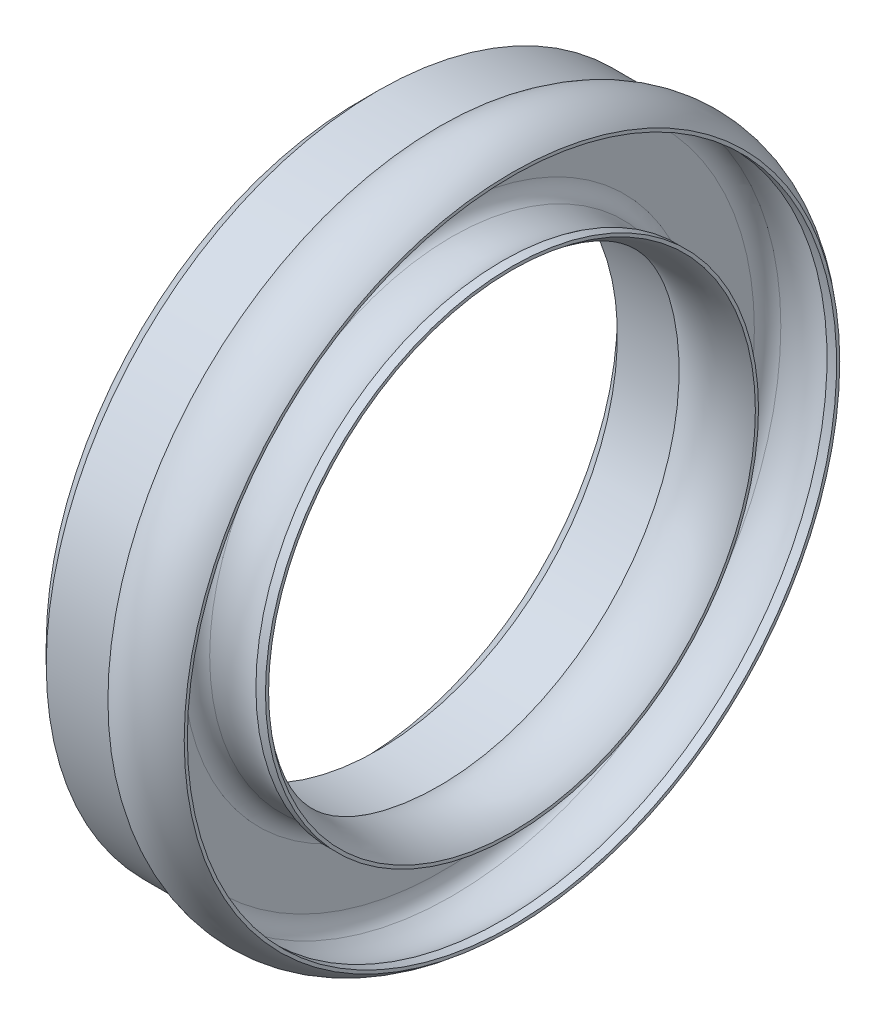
ISO-10303-21;
HEADER;
FILE_DESCRIPTION(('STEP AP214'),'2;1');
FILE_NAME('part.step','',(''),(''),'','','');
FILE_SCHEMA(('AUTOMOTIVE_DESIGN { 1 0 10303 214 1 1 1 1 }'));
ENDSEC;
DATA;
#1=APPLICATION_CONTEXT('core data for automotive mechanical design processes');
#2=APPLICATION_PROTOCOL_DEFINITION('international standard','automotive_design',2000,#1);
#3=PRODUCT_CONTEXT('',#1,'mechanical');
#4=PRODUCT('Part','Part','',(#3));
#5=PRODUCT_RELATED_PRODUCT_CATEGORY('part','',(#4));
#6=PRODUCT_DEFINITION_FORMATION('','',#4);
#7=PRODUCT_DEFINITION_CONTEXT('part definition',#1,'design');
#8=PRODUCT_DEFINITION('design','',#6,#7);
#9=PRODUCT_DEFINITION_SHAPE('','',#8);
#10=(LENGTH_UNIT() NAMED_UNIT(*) SI_UNIT(.MILLI.,.METRE.));
#11=(NAMED_UNIT(*) PLANE_ANGLE_UNIT() SI_UNIT($,.RADIAN.));
#12=(NAMED_UNIT(*) SI_UNIT($,.STERADIAN.) SOLID_ANGLE_UNIT());
#13=UNCERTAINTY_MEASURE_WITH_UNIT(LENGTH_MEASURE(1.E-05),#10,'distance_accuracy_value','');
#14=(GEOMETRIC_REPRESENTATION_CONTEXT(3) GLOBAL_UNCERTAINTY_ASSIGNED_CONTEXT((#13)) GLOBAL_UNIT_ASSIGNED_CONTEXT((#10,
#11,#12)) REPRESENTATION_CONTEXT('',''));
#15=CARTESIAN_POINT('',(0.,0.,0.));
#16=DIRECTION('',(0.,0.,1.));
#17=DIRECTION('',(1.,0.,0.));
#18=AXIS2_PLACEMENT_3D('',#15,#16,#17);
#19=CARTESIAN_POINT('',(2.79841658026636,0.,0.));
#20=DIRECTION('',(-0.999999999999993,0.,0.));
#21=DIRECTION('',(0.,0.,0.999999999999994));
#22=AXIS2_PLACEMENT_3D('',#19,#20,#21);
#23=TOROIDAL_SURFACE('',#22,8.69164894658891,0.508);
#24=CARTESIAN_POINT('',(2.57146885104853,0.,0.));
#25=DIRECTION('',(-0.999999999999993,0.,0.));
#26=DIRECTION('',(0.,0.,0.999999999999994));
#27=AXIS2_PLACEMENT_3D('',#24,#25,#26);
#28=CIRCLE('',#27,9.14613627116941);
#29=CARTESIAN_POINT('',(2.57146885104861,0.,9.14613627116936));
#30=VERTEX_POINT('',#29);
#31=EDGE_CURVE('E49',#30,#30,#28,.T.);
#32=ORIENTED_EDGE('',*,*,#31,.F.);
#33=EDGE_LOOP('',(#32));
#34=FACE_BOUND('',#33,.T.);
#35=CARTESIAN_POINT('',(2.29041658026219,0.,0.));
#36=DIRECTION('',(-0.999999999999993,0.,0.));
#37=DIRECTION('',(0.,0.,0.999999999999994));
#38=AXIS2_PLACEMENT_3D('',#35,#36,#37);
#39=CIRCLE('',#38,8.69164894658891);
#40=CARTESIAN_POINT('',(2.29041658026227,0.,8.69164894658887));
#41=VERTEX_POINT('',#40);
#42=EDGE_CURVE('E82',#41,#41,#39,.T.);
#43=ORIENTED_EDGE('',*,*,#42,.T.);
#44=EDGE_LOOP('',(#43));
#45=FACE_BOUND('',#44,.T.);
#46=ADVANCED_FACE('F30',(#34,#45),#23,.F.);
#47=CARTESIAN_POINT('',(3.17499999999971,0.,0.));
#48=DIRECTION('',(-0.999999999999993,0.,0.));
#49=DIRECTION('',(0.,0.,0.999999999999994));
#50=AXIS2_PLACEMENT_3D('',#47,#48,#49);
#51=TOROIDAL_SURFACE('',#50,7.9375,1.35094466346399);
#52=CARTESIAN_POINT('',(3.97912189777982,0.,0.));
#53=DIRECTION('',(-0.999999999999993,0.,0.));
#54=DIRECTION('',(0.,0.,0.999999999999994));
#55=AXIS2_PLACEMENT_3D('',#52,#53,#54);
#56=CIRCLE('',#55,9.02305951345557);
#57=CARTESIAN_POINT('',(3.9791218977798,0.,9.02305951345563));
#58=VERTEX_POINT('',#57);
#59=EDGE_CURVE('E52',#58,#58,#56,.T.);
#60=ORIENTED_EDGE('',*,*,#59,.F.);
#61=EDGE_LOOP('',(#60));
#62=FACE_BOUND('',#61,.T.);
#63=ORIENTED_EDGE('',*,*,#31,.T.);
#64=EDGE_LOOP('',(#63));
#65=FACE_BOUND('',#64,.T.);
#66=ADVANCED_FACE('F135',(#62,#65),#51,.F.);
#67=CARTESIAN_POINT('',(6.66133814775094E-13,0.,1.04083408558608E-13));
#68=DIRECTION('',(-0.999999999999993,0.,0.));
#69=DIRECTION('',(0.,0.,0.999999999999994));
#70=AXIS2_PLACEMENT_3D('',#67,#68,#69);
#71=CYLINDRICAL_SURFACE('',#70,9.02305951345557);
#72=CARTESIAN_POINT('',(4.24509077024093,0.,0.));
#73=DIRECTION('',(-0.999999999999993,0.,0.));
#74=DIRECTION('',(0.,0.,0.999999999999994));
#75=AXIS2_PLACEMENT_3D('',#72,#73,#74);
#76=CIRCLE('',#75,9.02305951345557);
#77=CARTESIAN_POINT('',(4.24509077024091,0.,9.02305951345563));
#78=VERTEX_POINT('',#77);
#79=EDGE_CURVE('E55',#78,#78,#76,.T.);
#80=CARTESIAN_POINT('',(4.24509077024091,0.,9.02305951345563));
#81=CARTESIAN_POINT('',(4.24232026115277,0.,9.02305951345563));
#82=CARTESIAN_POINT('',(4.23954975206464,0.,9.02305951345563));
#83=CARTESIAN_POINT('',(4.23400873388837,0.,9.02305951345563));
#84=CARTESIAN_POINT('',(4.23123822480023,0.,9.02305951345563));
#85=CARTESIAN_POINT('',(4.22569720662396,0.,9.02305951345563));
#86=CARTESIAN_POINT('',(4.22292669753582,0.,9.02305951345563));
#87=CARTESIAN_POINT('',(4.21738567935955,0.,9.02305951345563));
#88=CARTESIAN_POINT('',(4.21461517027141,0.,9.02305951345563));
#89=CARTESIAN_POINT('',(4.20907415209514,0.,9.02305951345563));
#90=CARTESIAN_POINT('',(4.206303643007,0.,9.02305951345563));
#91=CARTESIAN_POINT('',(4.20076262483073,0.,9.02305951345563));
#92=CARTESIAN_POINT('',(4.19799211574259,0.,9.02305951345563));
#93=CARTESIAN_POINT('',(4.19245109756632,0.,9.02305951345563));
#94=CARTESIAN_POINT('',(4.18968058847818,0.,9.02305951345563));
#95=CARTESIAN_POINT('',(4.18413957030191,0.,9.02305951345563));
#96=CARTESIAN_POINT('',(4.18136906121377,0.,9.02305951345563));
#97=CARTESIAN_POINT('',(4.1758280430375,0.,9.02305951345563));
#98=CARTESIAN_POINT('',(4.17305753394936,0.,9.02305951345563));
#99=CARTESIAN_POINT('',(4.16751651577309,0.,9.02305951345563));
#100=CARTESIAN_POINT('',(4.16474600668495,0.,9.02305951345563));
#101=CARTESIAN_POINT('',(4.15920498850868,0.,9.02305951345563));
#102=CARTESIAN_POINT('',(4.15643447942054,0.,9.02305951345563));
#103=CARTESIAN_POINT('',(4.15089346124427,0.,9.02305951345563));
#104=CARTESIAN_POINT('',(4.14812295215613,0.,9.02305951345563));
#105=CARTESIAN_POINT('',(4.14258193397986,0.,9.02305951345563));
#106=CARTESIAN_POINT('',(4.13981142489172,0.,9.02305951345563));
#107=CARTESIAN_POINT('',(4.13427040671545,0.,9.02305951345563));
#108=CARTESIAN_POINT('',(4.13149989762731,0.,9.02305951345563));
#109=CARTESIAN_POINT('',(4.12595887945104,0.,9.02305951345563));
#110=CARTESIAN_POINT('',(4.1231883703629,0.,9.02305951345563));
#111=CARTESIAN_POINT('',(4.11764735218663,0.,9.02305951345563));
#112=CARTESIAN_POINT('',(4.11487684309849,0.,9.02305951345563));
#113=CARTESIAN_POINT('',(4.10933582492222,0.,9.02305951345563));
#114=CARTESIAN_POINT('',(4.10656531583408,0.,9.02305951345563));
#115=CARTESIAN_POINT('',(4.10102429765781,0.,9.02305951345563));
#116=CARTESIAN_POINT('',(4.09825378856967,0.,9.02305951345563));
#117=CARTESIAN_POINT('',(4.0927127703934,0.,9.02305951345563));
#118=CARTESIAN_POINT('',(4.08994226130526,0.,9.02305951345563));
#119=CARTESIAN_POINT('',(4.08440124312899,0.,9.02305951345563));
#120=CARTESIAN_POINT('',(4.08163073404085,0.,9.02305951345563));
#121=CARTESIAN_POINT('',(4.07608971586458,0.,9.02305951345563));
#122=CARTESIAN_POINT('',(4.07331920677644,0.,9.02305951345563));
#123=CARTESIAN_POINT('',(4.06777818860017,0.,9.02305951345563));
#124=CARTESIAN_POINT('',(4.06500767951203,0.,9.02305951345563));
#125=CARTESIAN_POINT('',(4.05946666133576,0.,9.02305951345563));
#126=CARTESIAN_POINT('',(4.05669615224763,0.,9.02305951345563));
#127=CARTESIAN_POINT('',(4.05115513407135,0.,9.02305951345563));
#128=CARTESIAN_POINT('',(4.04838462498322,0.,9.02305951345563));
#129=CARTESIAN_POINT('',(4.04284360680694,0.,9.02305951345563));
#130=CARTESIAN_POINT('',(4.04007309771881,0.,9.02305951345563));
#131=CARTESIAN_POINT('',(4.03453207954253,0.,9.02305951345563));
#132=CARTESIAN_POINT('',(4.0317615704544,0.,9.02305951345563));
#133=CARTESIAN_POINT('',(4.02622055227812,0.,9.02305951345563));
#134=CARTESIAN_POINT('',(4.02345004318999,0.,9.02305951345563));
#135=CARTESIAN_POINT('',(4.01790902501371,0.,9.02305951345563));
#136=CARTESIAN_POINT('',(4.01513851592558,0.,9.02305951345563));
#137=CARTESIAN_POINT('',(4.0095974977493,0.,9.02305951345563));
#138=CARTESIAN_POINT('',(4.00682698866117,0.,9.02305951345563));
#139=CARTESIAN_POINT('',(4.0012859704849,0.,9.02305951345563));
#140=CARTESIAN_POINT('',(3.99851546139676,0.,9.02305951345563));
#141=CARTESIAN_POINT('',(3.99297444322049,0.,9.02305951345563));
#142=CARTESIAN_POINT('',(3.99020393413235,0.,9.02305951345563));
#143=CARTESIAN_POINT('',(3.98466291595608,0.,9.02305951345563));
#144=CARTESIAN_POINT('',(3.98189240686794,0.,9.02305951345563));
#145=CARTESIAN_POINT('',(3.9791218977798,0.,9.02305951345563));
#146=B_SPLINE_CURVE_WITH_KNOTS('',3,(#80,#81,#82,#83,#84,#85,#86,#87,#88,#89,#90,#91,#92,#93,
#94,#95,#96,#97,#98,#99,#100,#101,#102,#103,#104,#105,#106,#107,#108,#109,#110,#111,#112,#113,
#114,#115,#116,#117,#118,#119,#120,#121,#122,#123,#124,#125,#126,#127,#128,#129,#130,#131,#132,
#133,#134,#135,#136,#137,#138,#139,#140,#141,#142,#143,#144,#145),.UNSPECIFIED.,.F.,.F.,(4,2,2,
2,2,2,2,2,2,2,2,2,2,2,2,2,2,2,2,2,2,2,2,2,2,2,2,2,2,2,2,2,4),(0.,0.00831152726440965,
0.0166230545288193,0.0249345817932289,0.0332461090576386,0.0415576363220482,0.0498691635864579,
0.0581806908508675,0.0664922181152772,0.0748037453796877,0.0831152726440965,0.0914267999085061,
0.0997383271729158,0.108049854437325,0.116361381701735,0.124672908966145,0.132984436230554,
0.141295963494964,0.149607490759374,0.157919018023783,0.166230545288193,0.174542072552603,
0.182853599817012,0.191165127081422,0.199476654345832,0.207788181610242,0.216099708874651,
0.22441123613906,0.23272276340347,0.24103429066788,0.249345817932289,0.257657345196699,
0.265968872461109),.UNSPECIFIED.);
#147=EDGE_CURVE('BSEAM140',#78,#58,#146,.T.);
#148=ORIENTED_EDGE('',*,*,#79,.F.);
#149=ORIENTED_EDGE('',*,*,#59,.T.);
#150=ORIENTED_EDGE('',*,*,#147,.T.);
#151=ORIENTED_EDGE('',*,*,#147,.F.);
#152=EDGE_LOOP('',(#148,#150,#149,#151));
#153=FACE_BOUND('',#152,.T.);
#154=ADVANCED_FACE('F140',(#153),#71,.F.);
#155=CARTESIAN_POINT('',(4.24509077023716,9.1101303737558,0.));
#156=DIRECTION('',(-0.999999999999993,0.,0.));
#157=DIRECTION('',(0.,0.,0.999999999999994));
#158=AXIS2_PLACEMENT_3D('',#155,#156,#157);
#159=PLANE('',#158);
#160=CARTESIAN_POINT('',(4.24509077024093,0.,0.));
#161=DIRECTION('',(-0.999999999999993,0.,0.));
#162=DIRECTION('',(0.,0.,0.999999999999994));
#163=AXIS2_PLACEMENT_3D('',#160,#161,#162);
#164=CIRCLE('',#163,9.11013037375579);
#165=CARTESIAN_POINT('',(4.24509077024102,0.,9.11013037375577));
#166=VERTEX_POINT('',#165);
#167=EDGE_CURVE('E58',#166,#166,#164,.T.);
#168=ORIENTED_EDGE('',*,*,#167,.F.);
#169=EDGE_LOOP('',(#168));
#170=FACE_BOUND('',#169,.T.);
#171=ORIENTED_EDGE('',*,*,#79,.T.);
#172=EDGE_LOOP('',(#171));
#173=FACE_BOUND('',#172,.T.);
#174=ADVANCED_FACE('F147',(#170,#173),#159,.F.);
#175=CARTESIAN_POINT('',(3.17499999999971,0.,0.));
#176=DIRECTION('',(-0.999999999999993,0.,0.));
#177=DIRECTION('',(0.,0.,0.999999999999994));
#178=AXIS2_PLACEMENT_3D('',#175,#176,#177);
#179=TOROIDAL_SURFACE('',#178,7.9375,1.5875);
#180=CARTESIAN_POINT('',(2.2224999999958,0.,0.));
#181=DIRECTION('',(-0.999999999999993,0.,0.));
#182=DIRECTION('',(0.,0.,0.999999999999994));
#183=AXIS2_PLACEMENT_3D('',#180,#181,#182);
#184=CIRCLE('',#183,9.2075);
#185=CARTESIAN_POINT('',(2.22249999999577,0.,9.20750000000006));
#186=VERTEX_POINT('',#185);
#187=EDGE_CURVE('E61',#186,#186,#184,.T.);
#188=ORIENTED_EDGE('',*,*,#187,.F.);
#189=EDGE_LOOP('',(#188));
#190=FACE_BOUND('',#189,.T.);
#191=ORIENTED_EDGE('',*,*,#167,.T.);
#192=EDGE_LOOP('',(#191));
#193=FACE_BOUND('',#192,.T.);
#194=ADVANCED_FACE('F154',(#190,#193),#179,.T.);
#195=CARTESIAN_POINT('',(6.66133814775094E-13,0.,1.04083408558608E-13));
#196=DIRECTION('',(-0.999999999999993,0.,0.));
#197=DIRECTION('',(0.,0.,0.999999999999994));
#198=AXIS2_PLACEMENT_3D('',#195,#196,#197);
#199=CYLINDRICAL_SURFACE('',#198,9.2075);
#200=CARTESIAN_POINT('',(0.507999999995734,0.,0.));
#201=DIRECTION('',(0.999999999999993,0.,0.));
#202=DIRECTION('',(0.,0.,-0.999999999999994));
#203=AXIS2_PLACEMENT_3D('',#200,#201,#202);
#204=CIRCLE('',#203,9.2075);
#205=CARTESIAN_POINT('',(0.50799999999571,0.,9.20750000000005));
#206=VERTEX_POINT('',#205);
#207=EDGE_CURVE('E36',#206,#206,#204,.T.);
#208=CARTESIAN_POINT('',(0.50799999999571,0.,9.20750000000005));
#209=CARTESIAN_POINT('',(0.525859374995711,0.,9.20750000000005));
#210=CARTESIAN_POINT('',(0.543718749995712,0.,9.20750000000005));
#211=CARTESIAN_POINT('',(0.579437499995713,0.,9.20750000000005));
#212=CARTESIAN_POINT('',(0.597296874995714,0.,9.20750000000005));
#213=CARTESIAN_POINT('',(0.633015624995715,0.,9.20750000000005));
#214=CARTESIAN_POINT('',(0.650874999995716,0.,9.20750000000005));
#215=CARTESIAN_POINT('',(0.686593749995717,0.,9.20750000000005));
#216=CARTESIAN_POINT('',(0.704453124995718,0.,9.20750000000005));
#217=CARTESIAN_POINT('',(0.740171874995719,0.,9.20750000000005));
#218=CARTESIAN_POINT('',(0.75803124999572,0.,9.20750000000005));
#219=CARTESIAN_POINT('',(0.793749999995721,0.,9.20750000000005));
#220=CARTESIAN_POINT('',(0.811609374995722,0.,9.20750000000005));
#221=CARTESIAN_POINT('',(0.847328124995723,0.,9.20750000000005));
#222=CARTESIAN_POINT('',(0.865187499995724,0.,9.20750000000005));
#223=CARTESIAN_POINT('',(0.900906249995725,0.,9.20750000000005));
#224=CARTESIAN_POINT('',(0.918765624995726,0.,9.20750000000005));
#225=CARTESIAN_POINT('',(0.954484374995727,0.,9.20750000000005));
#226=CARTESIAN_POINT('',(0.972343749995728,0.,9.20750000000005));
#227=CARTESIAN_POINT('',(1.00806249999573,0.,9.20750000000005));
#228=CARTESIAN_POINT('',(1.02592187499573,0.,9.20750000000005));
#229=CARTESIAN_POINT('',(1.06164062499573,0.,9.20750000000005));
#230=CARTESIAN_POINT('',(1.07949999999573,0.,9.20750000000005));
#231=CARTESIAN_POINT('',(1.11521874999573,0.,9.20750000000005));
#232=CARTESIAN_POINT('',(1.13307812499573,0.,9.20750000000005));
#233=CARTESIAN_POINT('',(1.16879687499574,0.,9.20750000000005));
#234=CARTESIAN_POINT('',(1.18665624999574,0.,9.20750000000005));
#235=CARTESIAN_POINT('',(1.22237499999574,0.,9.20750000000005));
#236=CARTESIAN_POINT('',(1.24023437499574,0.,9.20750000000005));
#237=CARTESIAN_POINT('',(1.27595312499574,0.,9.20750000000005));
#238=CARTESIAN_POINT('',(1.29381249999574,0.,9.20750000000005));
#239=CARTESIAN_POINT('',(1.32953124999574,0.,9.20750000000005));
#240=CARTESIAN_POINT('',(1.34739062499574,0.,9.20750000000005));
#241=CARTESIAN_POINT('',(1.38310937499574,0.,9.20750000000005));
#242=CARTESIAN_POINT('',(1.40096874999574,0.,9.20750000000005));
#243=CARTESIAN_POINT('',(1.43668749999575,0.,9.20750000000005));
#244=CARTESIAN_POINT('',(1.45454687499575,0.,9.20750000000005));
#245=CARTESIAN_POINT('',(1.49026562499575,0.,9.20750000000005));
#246=CARTESIAN_POINT('',(1.50812499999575,0.,9.20750000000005));
#247=CARTESIAN_POINT('',(1.54384374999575,0.,9.20750000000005));
#248=CARTESIAN_POINT('',(1.56170312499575,0.,9.20750000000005));
#249=CARTESIAN_POINT('',(1.59742187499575,0.,9.20750000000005));
#250=CARTESIAN_POINT('',(1.61528124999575,0.,9.20750000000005));
#251=CARTESIAN_POINT('',(1.65099999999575,0.,9.20750000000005));
#252=CARTESIAN_POINT('',(1.66885937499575,0.,9.20750000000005));
#253=CARTESIAN_POINT('',(1.70457812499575,0.,9.20750000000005));
#254=CARTESIAN_POINT('',(1.72243749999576,0.,9.20750000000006));
#255=CARTESIAN_POINT('',(1.75815624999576,0.,9.20750000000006));
#256=CARTESIAN_POINT('',(1.77601562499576,0.,9.20750000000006));
#257=CARTESIAN_POINT('',(1.81173437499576,0.,9.20750000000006));
#258=CARTESIAN_POINT('',(1.82959374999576,0.,9.20750000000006));
#259=CARTESIAN_POINT('',(1.86531249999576,0.,9.20750000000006));
#260=CARTESIAN_POINT('',(1.88317187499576,0.,9.20750000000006));
#261=CARTESIAN_POINT('',(1.91889062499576,0.,9.20750000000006));
#262=CARTESIAN_POINT('',(1.93674999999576,0.,9.20750000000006));
#263=CARTESIAN_POINT('',(1.97246874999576,0.,9.20750000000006));
#264=CARTESIAN_POINT('',(1.99032812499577,0.,9.20750000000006));
#265=CARTESIAN_POINT('',(2.02604687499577,0.,9.20750000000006));
#266=CARTESIAN_POINT('',(2.04390624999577,0.,9.20750000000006));
#267=CARTESIAN_POINT('',(2.07962499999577,0.,9.20750000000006));
#268=CARTESIAN_POINT('',(2.09748437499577,0.,9.20750000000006));
#269=CARTESIAN_POINT('',(2.13320312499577,0.,9.20750000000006));
#270=CARTESIAN_POINT('',(2.15106249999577,0.,9.20750000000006));
#271=CARTESIAN_POINT('',(2.18678124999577,0.,9.20750000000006));
#272=CARTESIAN_POINT('',(2.20464062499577,0.,9.20750000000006));
#273=CARTESIAN_POINT('',(2.22249999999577,0.,9.20750000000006));
#274=B_SPLINE_CURVE_WITH_KNOTS('',3,(#208,#209,#210,#211,#212,#213,#214,#215,#216,#217,#218,
#219,#220,#221,#222,#223,#224,#225,#226,#227,#228,#229,#230,#231,#232,#233,#234,#235,#236,#237,
#238,#239,#240,#241,#242,#243,#244,#245,#246,#247,#248,#249,#250,#251,#252,#253,#254,#255,#256,
#257,#258,#259,#260,#261,#262,#263,#264,#265,#266,#267,#268,#269,#270,#271,#272,#273),
.UNSPECIFIED.,.F.,.F.,(4,2,2,2,2,2,2,2,2,2,2,2,2,2,2,2,2,2,2,2,2,2,2,2,2,2,2,2,2,2,2,2,4),(0.,
0.053578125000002,0.107156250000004,0.160734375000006,0.214312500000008,0.26789062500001,
0.321468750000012,0.375046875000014,0.428625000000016,0.482203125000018,0.53578125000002,
0.589359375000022,0.642937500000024,0.696515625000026,0.750093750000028,0.80367187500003,
0.857250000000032,0.910828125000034,0.964406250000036,1.01798437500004,1.07156250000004,
1.12514062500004,1.17871875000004,1.23229687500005,1.28587500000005,1.33945312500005,
1.39303125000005,1.44660937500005,1.50018750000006,1.55376562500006,1.60734375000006,
1.66092187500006,1.71450000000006),.UNSPECIFIED.);
#275=EDGE_CURVE('BSEAM131',#206,#186,#274,.T.);
#276=ORIENTED_EDGE('',*,*,#207,.T.);
#277=ORIENTED_EDGE('',*,*,#187,.T.);
#278=ORIENTED_EDGE('',*,*,#275,.T.);
#279=ORIENTED_EDGE('',*,*,#275,.F.);
#280=EDGE_LOOP('',(#276,#278,#277,#279));
#281=FACE_BOUND('',#280,.T.);
#282=ADVANCED_FACE('F131',(#281),#199,.T.);
#283=CARTESIAN_POINT('',(-4.44089209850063E-13,6.66750000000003,0.));
#284=DIRECTION('',(0.999999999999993,0.,0.));
#285=DIRECTION('',(0.,0.,-0.999999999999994));
#286=AXIS2_PLACEMENT_3D('',#283,#284,#285);
#287=PLANE('',#286);
#288=CARTESIAN_POINT('',(6.66133814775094E-13,0.,1.04083408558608E-13));
#289=DIRECTION('',(0.999999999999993,0.,0.));
#290=DIRECTION('',(0.,0.,-0.999999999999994));
#291=AXIS2_PLACEMENT_3D('',#288,#289,#290);
#292=CIRCLE('',#291,8.69949999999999);
#293=CARTESIAN_POINT('',(5.88655455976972E-13,0.,-8.69949999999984));
#294=VERTEX_POINT('',#293);
#295=EDGE_CURVE('E40',#294,#294,#292,.F.);
#296=ORIENTED_EDGE('',*,*,#295,.T.);
#297=EDGE_LOOP('',(#296));
#298=FACE_BOUND('',#297,.T.);
#299=CARTESIAN_POINT('',(6.66133814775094E-13,0.,1.04083408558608E-13));
#300=DIRECTION('',(0.999999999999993,0.,0.));
#301=DIRECTION('',(0.,0.,-0.999999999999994));
#302=AXIS2_PLACEMENT_3D('',#299,#300,#301);
#303=CIRCLE('',#302,7.1755);
#304=CARTESIAN_POINT('',(6.47810798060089E-13,0.,7.17549999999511));
#305=VERTEX_POINT('',#304);
#306=EDGE_CURVE('E44',#305,#305,#303,.T.);
#307=ORIENTED_EDGE('',*,*,#306,.T.);
#308=EDGE_LOOP('',(#307));
#309=FACE_BOUND('',#308,.T.);
#310=ADVANCED_FACE('F126',(#298,#309),#287,.F.);
#311=CARTESIAN_POINT('',(6.66133814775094E-13,0.,1.04083408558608E-13));
#312=DIRECTION('',(-0.999999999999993,0.,0.));
#313=DIRECTION('',(0.,0.,0.999999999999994));
#314=AXIS2_PLACEMENT_3D('',#311,#312,#313);
#315=CYLINDRICAL_SURFACE('',#314,6.6675);
#316=CARTESIAN_POINT('',(0.507999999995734,0.,0.));
#317=DIRECTION('',(0.999999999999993,0.,0.));
#318=DIRECTION('',(0.,0.,-0.999999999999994));
#319=AXIS2_PLACEMENT_3D('',#316,#317,#318);
#320=CIRCLE('',#319,6.6675);
#321=CARTESIAN_POINT('',(0.507999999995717,0.,6.66750000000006));
#322=VERTEX_POINT('',#321);
#323=EDGE_CURVE('E10',#322,#322,#320,.F.);
#324=CARTESIAN_POINT('',(2.2224999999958,0.,0.));
#325=DIRECTION('',(-0.999999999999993,0.,0.));
#326=DIRECTION('',(0.,0.,0.999999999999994));
#327=AXIS2_PLACEMENT_3D('',#324,#325,#326);
#328=CIRCLE('',#327,6.66749999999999);
#329=CARTESIAN_POINT('',(2.22249999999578,0.,6.66750000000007));
#330=VERTEX_POINT('',#329);
#331=EDGE_CURVE('E64',#330,#330,#328,.T.);
#332=CARTESIAN_POINT('',(0.507999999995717,0.,6.66750000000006));
#333=CARTESIAN_POINT('',(0.525859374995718,0.,6.66750000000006));
#334=CARTESIAN_POINT('',(0.543718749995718,0.,6.66750000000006));
#335=CARTESIAN_POINT('',(0.57943749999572,0.,6.66750000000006));
#336=CARTESIAN_POINT('',(0.59729687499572,0.,6.66750000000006));
#337=CARTESIAN_POINT('',(0.633015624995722,0.,6.66750000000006));
#338=CARTESIAN_POINT('',(0.650874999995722,0.,6.66750000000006));
#339=CARTESIAN_POINT('',(0.686593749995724,0.,6.66750000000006));
#340=CARTESIAN_POINT('',(0.704453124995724,0.,6.66750000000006));
#341=CARTESIAN_POINT('',(0.740171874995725,0.,6.66750000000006));
#342=CARTESIAN_POINT('',(0.758031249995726,0.,6.66750000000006));
#343=CARTESIAN_POINT('',(0.793749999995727,0.,6.66750000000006));
#344=CARTESIAN_POINT('',(0.811609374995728,0.,6.66750000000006));
#345=CARTESIAN_POINT('',(0.847328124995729,0.,6.66750000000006));
#346=CARTESIAN_POINT('',(0.86518749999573,0.,6.66750000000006));
#347=CARTESIAN_POINT('',(0.900906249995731,0.,6.66750000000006));
#348=CARTESIAN_POINT('',(0.918765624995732,0.,6.66750000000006));
#349=CARTESIAN_POINT('',(0.954484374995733,0.,6.66750000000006));
#350=CARTESIAN_POINT('',(0.972343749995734,0.,6.66750000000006));
#351=CARTESIAN_POINT('',(1.00806249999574,0.,6.66750000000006));
#352=CARTESIAN_POINT('',(1.02592187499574,0.,6.66750000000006));
#353=CARTESIAN_POINT('',(1.06164062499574,0.,6.66750000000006));
#354=CARTESIAN_POINT('',(1.07949999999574,0.,6.66750000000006));
#355=CARTESIAN_POINT('',(1.11521874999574,0.,6.66750000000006));
#356=CARTESIAN_POINT('',(1.13307812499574,0.,6.66750000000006));
#357=CARTESIAN_POINT('',(1.16879687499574,0.,6.66750000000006));
#358=CARTESIAN_POINT('',(1.18665624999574,0.,6.66750000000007));
#359=CARTESIAN_POINT('',(1.22237499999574,0.,6.66750000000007));
#360=CARTESIAN_POINT('',(1.24023437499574,0.,6.66750000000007));
#361=CARTESIAN_POINT('',(1.27595312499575,0.,6.66750000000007));
#362=CARTESIAN_POINT('',(1.29381249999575,0.,6.66750000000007));
#363=CARTESIAN_POINT('',(1.32953124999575,0.,6.66750000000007));
#364=CARTESIAN_POINT('',(1.34739062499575,0.,6.66750000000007));
#365=CARTESIAN_POINT('',(1.38310937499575,0.,6.66750000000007));
#366=CARTESIAN_POINT('',(1.40096874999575,0.,6.66750000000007));
#367=CARTESIAN_POINT('',(1.43668749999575,0.,6.66750000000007));
#368=CARTESIAN_POINT('',(1.45454687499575,0.,6.66750000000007));
#369=CARTESIAN_POINT('',(1.49026562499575,0.,6.66750000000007));
#370=CARTESIAN_POINT('',(1.50812499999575,0.,6.66750000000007));
#371=CARTESIAN_POINT('',(1.54384374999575,0.,6.66750000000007));
#372=CARTESIAN_POINT('',(1.56170312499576,0.,6.66750000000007));
#373=CARTESIAN_POINT('',(1.59742187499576,0.,6.66750000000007));
#374=CARTESIAN_POINT('',(1.61528124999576,0.,6.66750000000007));
#375=CARTESIAN_POINT('',(1.65099999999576,0.,6.66750000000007));
#376=CARTESIAN_POINT('',(1.66885937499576,0.,6.66750000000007));
#377=CARTESIAN_POINT('',(1.70457812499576,0.,6.66750000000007));
#378=CARTESIAN_POINT('',(1.72243749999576,0.,6.66750000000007));
#379=CARTESIAN_POINT('',(1.75815624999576,0.,6.66750000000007));
#380=CARTESIAN_POINT('',(1.77601562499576,0.,6.66750000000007));
#381=CARTESIAN_POINT('',(1.81173437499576,0.,6.66750000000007));
#382=CARTESIAN_POINT('',(1.82959374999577,0.,6.66750000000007));
#383=CARTESIAN_POINT('',(1.86531249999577,0.,6.66750000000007));
#384=CARTESIAN_POINT('',(1.88317187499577,0.,6.66750000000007));
#385=CARTESIAN_POINT('',(1.91889062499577,0.,6.66750000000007));
#386=CARTESIAN_POINT('',(1.93674999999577,0.,6.66750000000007));
#387=CARTESIAN_POINT('',(1.97246874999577,0.,6.66750000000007));
#388=CARTESIAN_POINT('',(1.99032812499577,0.,6.66750000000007));
#389=CARTESIAN_POINT('',(2.02604687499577,0.,6.66750000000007));
#390=CARTESIAN_POINT('',(2.04390624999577,0.,6.66750000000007));
#391=CARTESIAN_POINT('',(2.07962499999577,0.,6.66750000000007));
#392=CARTESIAN_POINT('',(2.09748437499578,0.,6.66750000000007));
#393=CARTESIAN_POINT('',(2.13320312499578,0.,6.66750000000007));
#394=CARTESIAN_POINT('',(2.15106249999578,0.,6.66750000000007));
#395=CARTESIAN_POINT('',(2.18678124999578,0.,6.66750000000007));
#396=CARTESIAN_POINT('',(2.20464062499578,0.,6.66750000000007));
#397=CARTESIAN_POINT('',(2.22249999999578,0.,6.66750000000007));
#398=B_SPLINE_CURVE_WITH_KNOTS('',3,(#332,#333,#334,#335,#336,#337,#338,#339,#340,#341,#342,
#343,#344,#345,#346,#347,#348,#349,#350,#351,#352,#353,#354,#355,#356,#357,#358,#359,#360,#361,
#362,#363,#364,#365,#366,#367,#368,#369,#370,#371,#372,#373,#374,#375,#376,#377,#378,#379,#380,
#381,#382,#383,#384,#385,#386,#387,#388,#389,#390,#391,#392,#393,#394,#395,#396,#397),
.UNSPECIFIED.,.F.,.F.,(4,2,2,2,2,2,2,2,2,2,2,2,2,2,2,2,2,2,2,2,2,2,2,2,2,2,2,2,2,2,2,2,4),(0.,
0.053578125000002,0.107156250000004,0.160734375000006,0.214312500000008,0.26789062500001,
0.321468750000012,0.375046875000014,0.428625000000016,0.482203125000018,0.53578125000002,
0.589359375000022,0.642937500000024,0.696515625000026,0.750093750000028,0.80367187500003,
0.857250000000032,0.910828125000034,0.964406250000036,1.01798437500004,1.07156250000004,
1.12514062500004,1.17871875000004,1.23229687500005,1.28587500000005,1.33945312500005,
1.39303125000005,1.44660937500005,1.50018750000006,1.55376562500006,1.60734375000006,
1.66092187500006,1.71450000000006),.UNSPECIFIED.);
#399=EDGE_CURVE('BSEAM121',#322,#330,#398,.T.);
#400=ORIENTED_EDGE('',*,*,#323,.T.);
#401=ORIENTED_EDGE('',*,*,#331,.F.);
#402=ORIENTED_EDGE('',*,*,#399,.T.);
#403=ORIENTED_EDGE('',*,*,#399,.F.);
#404=EDGE_LOOP('',(#400,#402,#401,#403));
#405=FACE_BOUND('',#404,.T.);
#406=ADVANCED_FACE('F121',(#405),#315,.F.);
#407=CARTESIAN_POINT('',(3.17499999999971,0.,0.));
#408=DIRECTION('',(-0.999999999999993,0.,0.));
#409=DIRECTION('',(0.,0.,0.999999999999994));
#410=AXIS2_PLACEMENT_3D('',#407,#408,#409);
#411=TOROIDAL_SURFACE('',#410,7.9375,1.5875);
#412=CARTESIAN_POINT('',(4.24509077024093,0.,0.));
#413=DIRECTION('',(-0.999999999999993,0.,0.));
#414=DIRECTION('',(0.,0.,0.999999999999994));
#415=AXIS2_PLACEMENT_3D('',#412,#413,#414);
#416=CIRCLE('',#415,6.7648696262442);
#417=CARTESIAN_POINT('',(4.24509077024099,0.,6.7648696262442));
#418=VERTEX_POINT('',#417);
#419=EDGE_CURVE('E67',#418,#418,#416,.T.);
#420=ORIENTED_EDGE('',*,*,#419,.F.);
#421=EDGE_LOOP('',(#420));
#422=FACE_BOUND('',#421,.T.);
#423=ORIENTED_EDGE('',*,*,#331,.T.);
#424=EDGE_LOOP('',(#423));
#425=FACE_BOUND('',#424,.T.);
#426=ADVANCED_FACE('F115',(#422,#425),#411,.T.);
#427=CARTESIAN_POINT('',(4.24509077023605,6.85194048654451,-1.2490009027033E-13));
#428=DIRECTION('',(-0.999999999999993,0.,0.));
#429=DIRECTION('',(0.,0.,0.999999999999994));
#430=AXIS2_PLACEMENT_3D('',#427,#428,#429);
#431=PLANE('',#430);
#432=CARTESIAN_POINT('',(4.24509077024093,0.,0.));
#433=DIRECTION('',(-0.999999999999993,0.,0.));
#434=DIRECTION('',(0.,0.,0.999999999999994));
#435=AXIS2_PLACEMENT_3D('',#432,#433,#434);
#436=CIRCLE('',#435,6.85194048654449);
#437=CARTESIAN_POINT('',(4.24509077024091,0.,6.85194048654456));
#438=VERTEX_POINT('',#437);
#439=EDGE_CURVE('E70',#438,#438,#436,.T.);
#440=ORIENTED_EDGE('',*,*,#439,.F.);
#441=EDGE_LOOP('',(#440));
#442=FACE_BOUND('',#441,.T.);
#443=ORIENTED_EDGE('',*,*,#419,.T.);
#444=EDGE_LOOP('',(#443));
#445=FACE_BOUND('',#444,.T.);
#446=ADVANCED_FACE('F109',(#442,#445),#431,.F.);
#447=CARTESIAN_POINT('',(6.66133814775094E-13,0.,1.04083408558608E-13));
#448=DIRECTION('',(-0.999999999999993,0.,0.));
#449=DIRECTION('',(0.,0.,0.999999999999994));
#450=AXIS2_PLACEMENT_3D('',#447,#448,#449);
#451=CYLINDRICAL_SURFACE('',#450,6.85194048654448);
#452=CARTESIAN_POINT('',(3.97912189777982,0.,0.));
#453=DIRECTION('',(-0.999999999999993,0.,0.));
#454=DIRECTION('',(0.,0.,0.999999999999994));
#455=AXIS2_PLACEMENT_3D('',#452,#453,#454);
#456=CIRCLE('',#455,6.85194048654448);
#457=CARTESIAN_POINT('',(3.97912189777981,0.,6.85194048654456));
#458=VERTEX_POINT('',#457);
#459=EDGE_CURVE('E73',#458,#458,#456,.T.);
#460=CARTESIAN_POINT('',(3.97912189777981,0.,6.85194048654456));
#461=CARTESIAN_POINT('',(3.98189240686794,0.,6.85194048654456));
#462=CARTESIAN_POINT('',(3.98466291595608,0.,6.85194048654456));
#463=CARTESIAN_POINT('',(3.99020393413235,0.,6.85194048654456));
#464=CARTESIAN_POINT('',(3.99297444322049,0.,6.85194048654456));
#465=CARTESIAN_POINT('',(3.99851546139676,0.,6.85194048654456));
#466=CARTESIAN_POINT('',(4.0012859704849,0.,6.85194048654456));
#467=CARTESIAN_POINT('',(4.00682698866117,0.,6.85194048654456));
#468=CARTESIAN_POINT('',(4.00959749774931,0.,6.85194048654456));
#469=CARTESIAN_POINT('',(4.01513851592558,0.,6.85194048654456));
#470=CARTESIAN_POINT('',(4.01790902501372,0.,6.85194048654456));
#471=CARTESIAN_POINT('',(4.02345004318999,0.,6.85194048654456));
#472=CARTESIAN_POINT('',(4.02622055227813,0.,6.85194048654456));
#473=CARTESIAN_POINT('',(4.0317615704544,0.,6.85194048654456));
#474=CARTESIAN_POINT('',(4.03453207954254,0.,6.85194048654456));
#475=CARTESIAN_POINT('',(4.04007309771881,0.,6.85194048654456));
#476=CARTESIAN_POINT('',(4.04284360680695,0.,6.85194048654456));
#477=CARTESIAN_POINT('',(4.04838462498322,0.,6.85194048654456));
#478=CARTESIAN_POINT('',(4.05115513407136,0.,6.85194048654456));
#479=CARTESIAN_POINT('',(4.05669615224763,0.,6.85194048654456));
#480=CARTESIAN_POINT('',(4.05946666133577,0.,6.85194048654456));
#481=CARTESIAN_POINT('',(4.06500767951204,0.,6.85194048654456));
#482=CARTESIAN_POINT('',(4.06777818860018,0.,6.85194048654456));
#483=CARTESIAN_POINT('',(4.07331920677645,0.,6.85194048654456));
#484=CARTESIAN_POINT('',(4.07608971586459,0.,6.85194048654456));
#485=CARTESIAN_POINT('',(4.08163073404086,0.,6.85194048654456));
#486=CARTESIAN_POINT('',(4.084401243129,0.,6.85194048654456));
#487=CARTESIAN_POINT('',(4.08994226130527,0.,6.85194048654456));
#488=CARTESIAN_POINT('',(4.09271277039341,0.,6.85194048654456));
#489=CARTESIAN_POINT('',(4.09825378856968,0.,6.85194048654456));
#490=CARTESIAN_POINT('',(4.10102429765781,0.,6.85194048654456));
#491=CARTESIAN_POINT('',(4.10656531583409,0.,6.85194048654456));
#492=CARTESIAN_POINT('',(4.10933582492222,0.,6.85194048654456));
#493=CARTESIAN_POINT('',(4.1148768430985,0.,6.85194048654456));
#494=CARTESIAN_POINT('',(4.11764735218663,0.,6.85194048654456));
#495=CARTESIAN_POINT('',(4.12318837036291,0.,6.85194048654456));
#496=CARTESIAN_POINT('',(4.12595887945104,0.,6.85194048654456));
#497=CARTESIAN_POINT('',(4.13149989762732,0.,6.85194048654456));
#498=CARTESIAN_POINT('',(4.13427040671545,0.,6.85194048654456));
#499=CARTESIAN_POINT('',(4.13981142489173,0.,6.85194048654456));
#500=CARTESIAN_POINT('',(4.14258193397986,0.,6.85194048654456));
#501=CARTESIAN_POINT('',(4.14812295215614,0.,6.85194048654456));
#502=CARTESIAN_POINT('',(4.15089346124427,0.,6.85194048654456));
#503=CARTESIAN_POINT('',(4.15643447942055,0.,6.85194048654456));
#504=CARTESIAN_POINT('',(4.15920498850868,0.,6.85194048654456));
#505=CARTESIAN_POINT('',(4.16474600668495,0.,6.85194048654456));
#506=CARTESIAN_POINT('',(4.16751651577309,0.,6.85194048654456));
#507=CARTESIAN_POINT('',(4.17305753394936,0.,6.85194048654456));
#508=CARTESIAN_POINT('',(4.1758280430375,0.,6.85194048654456));
#509=CARTESIAN_POINT('',(4.18136906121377,0.,6.85194048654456));
#510=CARTESIAN_POINT('',(4.18413957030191,0.,6.85194048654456));
#511=CARTESIAN_POINT('',(4.18968058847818,0.,6.85194048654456));
#512=CARTESIAN_POINT('',(4.19245109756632,0.,6.85194048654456));
#513=CARTESIAN_POINT('',(4.19799211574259,0.,6.85194048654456));
#514=CARTESIAN_POINT('',(4.20076262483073,0.,6.85194048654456));
#515=CARTESIAN_POINT('',(4.206303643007,0.,6.85194048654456));
#516=CARTESIAN_POINT('',(4.20907415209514,0.,6.85194048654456));
#517=CARTESIAN_POINT('',(4.21461517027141,0.,6.85194048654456));
#518=CARTESIAN_POINT('',(4.21738567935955,0.,6.85194048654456));
#519=CARTESIAN_POINT('',(4.22292669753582,0.,6.85194048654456));
#520=CARTESIAN_POINT('',(4.22569720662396,0.,6.85194048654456));
#521=CARTESIAN_POINT('',(4.23123822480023,0.,6.85194048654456));
#522=CARTESIAN_POINT('',(4.23400873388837,0.,6.85194048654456));
#523=CARTESIAN_POINT('',(4.23954975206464,0.,6.85194048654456));
#524=CARTESIAN_POINT('',(4.24232026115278,0.,6.85194048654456));
#525=CARTESIAN_POINT('',(4.24509077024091,0.,6.85194048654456));
#526=B_SPLINE_CURVE_WITH_KNOTS('',3,(#460,#461,#462,#463,#464,#465,#466,#467,#468,#469,#470,
#471,#472,#473,#474,#475,#476,#477,#478,#479,#480,#481,#482,#483,#484,#485,#486,#487,#488,#489,
#490,#491,#492,#493,#494,#495,#496,#497,#498,#499,#500,#501,#502,#503,#504,#505,#506,#507,#508,
#509,#510,#511,#512,#513,#514,#515,#516,#517,#518,#519,#520,#521,#522,#523,#524,#525),
.UNSPECIFIED.,.F.,.F.,(4,2,2,2,2,2,2,2,2,2,2,2,2,2,2,2,2,2,2,2,2,2,2,2,2,2,2,2,2,2,2,2,4),(0.,
0.00831152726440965,0.0166230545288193,0.0249345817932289,0.0332461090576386,0.0415576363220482,
0.0498691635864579,0.0581806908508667,0.0664922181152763,0.0748037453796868,0.0831152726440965,
0.0914267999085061,0.0997383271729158,0.108049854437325,0.116361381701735,0.124672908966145,
0.132984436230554,0.141295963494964,0.149607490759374,0.157919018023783,0.166230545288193,
0.174542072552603,0.182853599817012,0.191165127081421,0.199476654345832,0.207788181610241,
0.216099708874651,0.22441123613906,0.23272276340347,0.24103429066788,0.249345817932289,
0.257657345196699,0.265968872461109),.UNSPECIFIED.);
#527=EDGE_CURVE('BSEAM103',#458,#438,#526,.T.);
#528=ORIENTED_EDGE('',*,*,#459,.F.);
#529=ORIENTED_EDGE('',*,*,#439,.T.);
#530=ORIENTED_EDGE('',*,*,#527,.T.);
#531=ORIENTED_EDGE('',*,*,#527,.F.);
#532=EDGE_LOOP('',(#528,#530,#529,#531));
#533=FACE_BOUND('',#532,.T.);
#534=ADVANCED_FACE('F103',(#533),#451,.T.);
#535=CARTESIAN_POINT('',(3.17499999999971,0.,0.));
#536=DIRECTION('',(-0.999999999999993,0.,0.));
#537=DIRECTION('',(0.,0.,0.999999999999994));
#538=AXIS2_PLACEMENT_3D('',#535,#536,#537);
#539=TOROIDAL_SURFACE('',#538,7.9375,1.35094466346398);
#540=CARTESIAN_POINT('',(2.57146885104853,0.,0.));
#541=DIRECTION('',(-0.999999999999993,0.,0.));
#542=DIRECTION('',(0.,0.,0.999999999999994));
#543=AXIS2_PLACEMENT_3D('',#540,#541,#542);
#544=CIRCLE('',#543,6.7288637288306);
#545=CARTESIAN_POINT('',(2.57146885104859,0.,6.72886372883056));
#546=VERTEX_POINT('',#545);
#547=EDGE_CURVE('E76',#546,#546,#544,.T.);
#548=ORIENTED_EDGE('',*,*,#547,.F.);
#549=EDGE_LOOP('',(#548));
#550=FACE_BOUND('',#549,.T.);
#551=ORIENTED_EDGE('',*,*,#459,.T.);
#552=EDGE_LOOP('',(#551));
#553=FACE_BOUND('',#552,.T.);
#554=ADVANCED_FACE('F97',(#550,#553),#539,.F.);
#555=CARTESIAN_POINT('',(2.79841658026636,0.,0.));
#556=DIRECTION('',(-0.999999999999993,0.,0.));
#557=DIRECTION('',(0.,0.,0.999999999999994));
#558=AXIS2_PLACEMENT_3D('',#555,#556,#557);
#559=TOROIDAL_SURFACE('',#558,7.18335105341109,0.508);
#560=CARTESIAN_POINT('',(2.29041658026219,0.,0.));
#561=DIRECTION('',(-0.999999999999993,0.,0.));
#562=DIRECTION('',(0.,0.,0.999999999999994));
#563=AXIS2_PLACEMENT_3D('',#560,#561,#562);
#564=CIRCLE('',#563,7.18335105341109);
#565=CARTESIAN_POINT('',(2.29041658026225,0.,7.18335105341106));
#566=VERTEX_POINT('',#565);
#567=EDGE_CURVE('E79',#566,#566,#564,.T.);
#568=ORIENTED_EDGE('',*,*,#567,.F.);
#569=EDGE_LOOP('',(#568));
#570=FACE_BOUND('',#569,.T.);
#571=ORIENTED_EDGE('',*,*,#547,.T.);
#572=EDGE_LOOP('',(#571));
#573=FACE_BOUND('',#572,.T.);
#574=ADVANCED_FACE('F91',(#570,#573),#559,.F.);
#575=CARTESIAN_POINT('',(2.29041658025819,8.69164894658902,0.));
#576=DIRECTION('',(-0.999999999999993,0.,0.));
#577=DIRECTION('',(0.,0.,0.999999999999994));
#578=AXIS2_PLACEMENT_3D('',#575,#576,#577);
#579=PLANE('',#578);
#580=ORIENTED_EDGE('',*,*,#42,.F.);
#581=EDGE_LOOP('',(#580));
#582=FACE_BOUND('',#581,.T.);
#583=ORIENTED_EDGE('',*,*,#567,.T.);
#584=EDGE_LOOP('',(#583));
#585=FACE_BOUND('',#584,.T.);
#586=ADVANCED_FACE('F87',(#582,#585),#579,.F.);
#587=CARTESIAN_POINT('',(6.66133814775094E-13,0.,1.04083408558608E-13));
#588=DIRECTION('',(0.999999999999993,0.,0.));
#589=DIRECTION('',(0.,0.,-0.999999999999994));
#590=AXIS2_PLACEMENT_3D('',#587,#588,#589);
#591=CONICAL_SURFACE('',#590,8.69949999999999,0.785398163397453);
#592=ORIENTED_EDGE('',*,*,#207,.F.);
#593=EDGE_LOOP('',(#592));
#594=FACE_BOUND('',#593,.T.);
#595=ORIENTED_EDGE('',*,*,#295,.F.);
#596=EDGE_LOOP('',(#595));
#597=FACE_BOUND('',#596,.T.);
#598=ADVANCED_FACE('F90',(#594,#597),#591,.T.);
#599=CARTESIAN_POINT('',(0.507999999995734,0.,0.));
#600=DIRECTION('',(-0.999999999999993,0.,0.));
#601=DIRECTION('',(0.,0.,0.999999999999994));
#602=AXIS2_PLACEMENT_3D('',#599,#600,#601);
#603=CONICAL_SURFACE('',#602,6.6675,0.785398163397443);
#604=CARTESIAN_POINT('',(6.47810798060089E-13,0.,7.17549999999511));
#605=CARTESIAN_POINT('',(0.00529166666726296,0.,7.1702083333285));
#606=CARTESIAN_POINT('',(0.0105833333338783,0.,7.16491666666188));
#607=CARTESIAN_POINT('',(0.0211666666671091,0.,7.15433333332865));
#608=CARTESIAN_POINT('',(0.0264583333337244,0.,7.14904166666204));
#609=CARTESIAN_POINT('',(0.0370416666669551,0.,7.13845833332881));
#610=CARTESIAN_POINT('',(0.0423333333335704,0.,7.13316666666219));
#611=CARTESIAN_POINT('',(0.0529166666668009,0.,7.12258333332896));
#612=CARTESIAN_POINT('',(0.0582083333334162,0.,7.11729166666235));
#613=CARTESIAN_POINT('',(0.0687916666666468,0.,7.10670833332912));
#614=CARTESIAN_POINT('',(0.074083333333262,0.,7.1014166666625));
#615=CARTESIAN_POINT('',(0.0846666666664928,0.,7.09083333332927));
#616=CARTESIAN_POINT('',(0.0899583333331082,0.,7.08554166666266));
#617=CARTESIAN_POINT('',(0.100541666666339,0.,7.07495833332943));
#618=CARTESIAN_POINT('',(0.105833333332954,0.,7.06966666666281));
#619=CARTESIAN_POINT('',(0.116416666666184,0.,7.05908333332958));
#620=CARTESIAN_POINT('',(0.1217083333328,0.,7.05379166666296));
#621=CARTESIAN_POINT('',(0.13229166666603,0.,7.04320833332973));
#622=CARTESIAN_POINT('',(0.137583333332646,0.,7.03791666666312));
#623=CARTESIAN_POINT('',(0.148166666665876,0.,7.02733333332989));
#624=CARTESIAN_POINT('',(0.153458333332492,0.,7.02204166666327));
#625=CARTESIAN_POINT('',(0.164041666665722,0.,7.01145833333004));
#626=CARTESIAN_POINT('',(0.169333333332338,0.,7.00616666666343));
#627=CARTESIAN_POINT('',(0.179916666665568,0.,6.9955833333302));
#628=CARTESIAN_POINT('',(0.185208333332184,0.,6.99029166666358));
#629=CARTESIAN_POINT('',(0.195791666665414,0.,6.97970833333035));
#630=CARTESIAN_POINT('',(0.201083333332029,0.,6.97441666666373));
#631=CARTESIAN_POINT('',(0.21166666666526,0.,6.9638333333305));
#632=CARTESIAN_POINT('',(0.216958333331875,0.,6.95854166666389));
#633=CARTESIAN_POINT('',(0.227541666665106,0.,6.94795833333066));
#634=CARTESIAN_POINT('',(0.232833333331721,0.,6.94266666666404));
#635=CARTESIAN_POINT('',(0.243416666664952,0.,6.93208333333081));
#636=CARTESIAN_POINT('',(0.248708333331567,0.,6.9267916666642));
#637=CARTESIAN_POINT('',(0.259291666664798,0.,6.91620833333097));
#638=CARTESIAN_POINT('',(0.264583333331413,0.,6.91091666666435));
#639=CARTESIAN_POINT('',(0.275166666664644,0.,6.90033333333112));
#640=CARTESIAN_POINT('',(0.280458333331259,0.,6.8950416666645));
#641=CARTESIAN_POINT('',(0.29104166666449,0.,6.88445833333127));
#642=CARTESIAN_POINT('',(0.296333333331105,0.,6.87916666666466));
#643=CARTESIAN_POINT('',(0.306916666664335,0.,6.86858333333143));
#644=CARTESIAN_POINT('',(0.312208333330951,0.,6.86329166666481));
#645=CARTESIAN_POINT('',(0.322791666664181,0.,6.85270833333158));
#646=CARTESIAN_POINT('',(0.328083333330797,0.,6.84741666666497));
#647=CARTESIAN_POINT('',(0.338666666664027,0.,6.83683333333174));
#648=CARTESIAN_POINT('',(0.343958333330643,0.,6.83154166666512));
#649=CARTESIAN_POINT('',(0.354541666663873,0.,6.82095833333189));
#650=CARTESIAN_POINT('',(0.359833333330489,0.,6.81566666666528));
#651=CARTESIAN_POINT('',(0.370416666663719,0.,6.80508333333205));
#652=CARTESIAN_POINT('',(0.375708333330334,0.,6.79979166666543));
#653=CARTESIAN_POINT('',(0.386291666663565,0.,6.7892083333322));
#654=CARTESIAN_POINT('',(0.39158333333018,0.,6.78391666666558));
#655=CARTESIAN_POINT('',(0.402166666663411,0.,6.77333333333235));
#656=CARTESIAN_POINT('',(0.407458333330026,0.,6.76804166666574));
#657=CARTESIAN_POINT('',(0.418041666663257,0.,6.75745833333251));
#658=CARTESIAN_POINT('',(0.423333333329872,0.,6.75216666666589));
#659=CARTESIAN_POINT('',(0.433916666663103,0.,6.74158333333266));
#660=CARTESIAN_POINT('',(0.439208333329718,0.,6.73629166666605));
#661=CARTESIAN_POINT('',(0.449791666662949,0.,6.72570833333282));
#662=CARTESIAN_POINT('',(0.455083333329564,0.,6.7204166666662));
#663=CARTESIAN_POINT('',(0.465666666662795,0.,6.70983333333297));
#664=CARTESIAN_POINT('',(0.47095833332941,0.,6.70454166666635));
#665=CARTESIAN_POINT('',(0.48154166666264,0.,6.69395833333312));
#666=CARTESIAN_POINT('',(0.486833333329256,0.,6.68866666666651));
#667=CARTESIAN_POINT('',(0.497416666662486,0.,6.67808333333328));
#668=CARTESIAN_POINT('',(0.502708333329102,0.,6.67279166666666));
#669=CARTESIAN_POINT('',(0.507999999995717,0.,6.66750000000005));
#670=B_SPLINE_CURVE_WITH_KNOTS('',3,(#604,#605,#606,#607,#608,#609,#610,#611,#612,#613,#614,
#615,#616,#617,#618,#619,#620,#621,#622,#623,#624,#625,#626,#627,#628,#629,#630,#631,#632,#633,
#634,#635,#636,#637,#638,#639,#640,#641,#642,#643,#644,#645,#646,#647,#648,#649,#650,#651,#652,
#653,#654,#655,#656,#657,#658,#659,#660,#661,#662,#663,#664,#665,#666,#667,#668,#669),
.UNSPECIFIED.,.F.,.F.,(4,2,2,2,2,2,2,2,2,2,2,2,2,2,2,2,2,2,2,2,2,2,2,2,2,2,2,2,2,2,2,2,4),(0.,
0.022450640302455,0.0449012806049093,0.0673519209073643,0.0898025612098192,0.112253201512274,
0.134703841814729,0.157154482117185,0.17960512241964,0.202055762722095,0.224506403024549,
0.246957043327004,0.269407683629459,0.291858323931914,0.314308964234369,0.336759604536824,
0.359210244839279,0.381660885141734,0.404111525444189,0.426562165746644,0.449012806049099,
0.471463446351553,0.493914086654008,0.516364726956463,0.538815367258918,0.561266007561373,
0.583716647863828,0.606167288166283,0.628617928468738,0.651068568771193,0.673519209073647,
0.695969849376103,0.718420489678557),.UNSPECIFIED.);
#671=EDGE_CURVE('BSEAM224',#305,#322,#670,.T.);
#672=ORIENTED_EDGE('',*,*,#306,.F.);
#673=ORIENTED_EDGE('',*,*,#323,.F.);
#674=ORIENTED_EDGE('',*,*,#671,.T.);
#675=ORIENTED_EDGE('',*,*,#671,.F.);
#676=EDGE_LOOP('',(#672,#674,#673,#675));
#677=FACE_BOUND('',#676,.T.);
#678=ADVANCED_FACE('F224',(#677),#603,.F.);
#679=CLOSED_SHELL('',(#46,#66,#154,#174,#194,#282,#310,#406,#426,#446,#534,#554,#574,#586,#598,#678));
#680=MANIFOLD_SOLID_BREP('B2',#679);
#681=ADVANCED_BREP_SHAPE_REPRESENTATION('',(#18,#680),#14);
#682=SHAPE_DEFINITION_REPRESENTATION(#9,#681);
ENDSEC;
END-ISO-10303-21;
